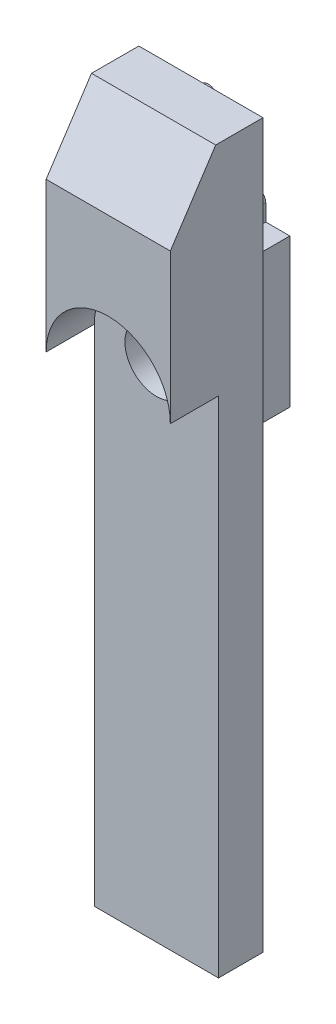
ISO-10303-21;
HEADER;
FILE_DESCRIPTION(('STEP AP214'),'2;1');
FILE_NAME('part.step','',(''),(''),'','','');
FILE_SCHEMA(('AUTOMOTIVE_DESIGN { 1 0 10303 214 1 1 1 1 }'));
ENDSEC;
DATA;
#1=APPLICATION_CONTEXT('core data for automotive mechanical design processes');
#2=APPLICATION_PROTOCOL_DEFINITION('international standard','automotive_design',2000,#1);
#3=PRODUCT_CONTEXT('',#1,'mechanical');
#4=PRODUCT('Part','Part','',(#3));
#5=PRODUCT_RELATED_PRODUCT_CATEGORY('part','',(#4));
#6=PRODUCT_DEFINITION_FORMATION('','',#4);
#7=PRODUCT_DEFINITION_CONTEXT('part definition',#1,'design');
#8=PRODUCT_DEFINITION('design','',#6,#7);
#9=PRODUCT_DEFINITION_SHAPE('','',#8);
#10=(LENGTH_UNIT() NAMED_UNIT(*) SI_UNIT(.MILLI.,.METRE.));
#11=(NAMED_UNIT(*) PLANE_ANGLE_UNIT() SI_UNIT($,.RADIAN.));
#12=(NAMED_UNIT(*) SI_UNIT($,.STERADIAN.) SOLID_ANGLE_UNIT());
#13=UNCERTAINTY_MEASURE_WITH_UNIT(LENGTH_MEASURE(1.E-05),#10,'distance_accuracy_value','');
#14=(GEOMETRIC_REPRESENTATION_CONTEXT(3) GLOBAL_UNCERTAINTY_ASSIGNED_CONTEXT((#13)) GLOBAL_UNIT_ASSIGNED_CONTEXT((#10,
#11,#12)) REPRESENTATION_CONTEXT('',''));
#15=CARTESIAN_POINT('',(0.,0.,0.));
#16=DIRECTION('',(0.,0.,1.));
#17=DIRECTION('',(1.,0.,0.));
#18=AXIS2_PLACEMENT_3D('',#15,#16,#17);
#19=CARTESIAN_POINT('',(16.75,97.5,0.));
#20=DIRECTION('',(0.,0.,-1.));
#21=DIRECTION('',(-1.,0.,0.));
#22=AXIS2_PLACEMENT_3D('',#19,#20,#21);
#23=PLANE('',#22);
#24=CARTESIAN_POINT('',(0.,93.5,0.));
#25=DIRECTION('',(0.,0.,-1.));
#26=DIRECTION('',(-1.,0.,0.));
#27=AXIS2_PLACEMENT_3D('',#24,#25,#26);
#28=CIRCLE('',#27,2.5);
#29=CARTESIAN_POINT('',(-2.5,93.5,0.));
#30=VERTEX_POINT('',#29);
#31=EDGE_CURVE('E518',#30,#30,#28,.T.);
#32=ORIENTED_EDGE('',*,*,#31,.F.);
#33=EDGE_LOOP('',(#32));
#34=FACE_BOUND('',#33,.T.);
#35=DIRECTION('',(0.,1.,0.));
#36=VECTOR('',#35,1.);
#37=CARTESIAN_POINT('',(16.75,-97.5,0.));
#38=LINE('',#37,#36);
#39=CARTESIAN_POINT('',(16.75,-97.5,0.));
#40=VERTEX_POINT('',#39);
#41=CARTESIAN_POINT('',(16.75,97.5,0.));
#42=VERTEX_POINT('',#41);
#43=EDGE_CURVE('E221',#40,#42,#38,.T.);
#44=ORIENTED_EDGE('',*,*,#43,.F.);
#45=DIRECTION('',(1.,0.,0.));
#46=VECTOR('',#45,1.);
#47=CARTESIAN_POINT('',(-16.75,-97.5,0.));
#48=LINE('',#47,#46);
#49=CARTESIAN_POINT('',(-16.75,-97.5,0.));
#50=VERTEX_POINT('',#49);
#51=EDGE_CURVE('E227',#50,#40,#48,.T.);
#52=ORIENTED_EDGE('',*,*,#51,.F.);
#53=DIRECTION('',(0.,-1.,0.));
#54=VECTOR('',#53,1.);
#55=CARTESIAN_POINT('',(-16.75,-97.5,0.));
#56=LINE('',#55,#54);
#57=CARTESIAN_POINT('',(-16.75,97.5,0.));
#58=VERTEX_POINT('',#57);
#59=EDGE_CURVE('E235',#58,#50,#56,.T.);
#60=ORIENTED_EDGE('',*,*,#59,.F.);
#61=DIRECTION('',(-1.,0.,0.));
#62=VECTOR('',#61,1.);
#63=CARTESIAN_POINT('',(-16.75,97.5,0.));
#64=LINE('',#63,#62);
#65=EDGE_CURVE('E232',#42,#58,#64,.T.);
#66=ORIENTED_EDGE('',*,*,#65,.F.);
#67=EDGE_LOOP('',(#44,#52,#60,#66));
#68=FACE_BOUND('',#67,.T.);
#69=DIRECTION('',(1.,0.,0.));
#70=VECTOR('',#69,1.);
#71=CARTESIAN_POINT('',(-2.5,58.5,0.));
#72=LINE('',#71,#70);
#73=CARTESIAN_POINT('',(-9.,58.5,0.));
#74=VERTEX_POINT('',#73);
#75=CARTESIAN_POINT('',(-2.5,58.5,0.));
#76=VERTEX_POINT('',#75);
#77=EDGE_CURVE('E552',#74,#76,#72,.T.);
#78=ORIENTED_EDGE('',*,*,#77,.F.);
#79=DIRECTION('',(0.,1.,0.));
#80=VECTOR('',#79,1.);
#81=CARTESIAN_POINT('',(-9.,18.5,0.));
#82=LINE('',#81,#80);
#83=CARTESIAN_POINT('',(-9.,18.5,0.));
#84=VERTEX_POINT('',#83);
#85=EDGE_CURVE('E188',#84,#74,#82,.T.);
#86=ORIENTED_EDGE('',*,*,#85,.F.);
#87=DIRECTION('',(-1.,0.,0.));
#88=VECTOR('',#87,1.);
#89=CARTESIAN_POINT('',(-2.5,18.5,0.));
#90=LINE('',#89,#88);
#91=CARTESIAN_POINT('',(-2.50000000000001,18.5,0.));
#92=VERTEX_POINT('',#91);
#93=EDGE_CURVE('E184',#92,#84,#90,.T.);
#94=ORIENTED_EDGE('',*,*,#93,.F.);
#95=DIRECTION('',(0.,1.,0.));
#96=VECTOR('',#95,1.);
#97=CARTESIAN_POINT('',(-2.5,18.5,0.));
#98=LINE('',#97,#96);
#99=CARTESIAN_POINT('',(-2.5,14.,0.));
#100=VERTEX_POINT('',#99);
#101=EDGE_CURVE('E570',#100,#92,#98,.T.);
#102=ORIENTED_EDGE('',*,*,#101,.F.);
#103=CARTESIAN_POINT('',(0.,14.,0.));
#104=DIRECTION('',(0.,0.,-1.));
#105=DIRECTION('',(1.,0.,0.));
#106=AXIS2_PLACEMENT_3D('',#103,#104,#105);
#107=CIRCLE('',#106,2.5);
#108=CARTESIAN_POINT('',(2.49999999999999,14.,0.));
#109=VERTEX_POINT('',#108);
#110=EDGE_CURVE('E568',#109,#100,#107,.T.);
#111=ORIENTED_EDGE('',*,*,#110,.F.);
#112=DIRECTION('',(0.,-1.,0.));
#113=VECTOR('',#112,1.);
#114=CARTESIAN_POINT('',(2.49999999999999,18.5,0.));
#115=LINE('',#114,#113);
#116=CARTESIAN_POINT('',(2.49999999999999,18.5,0.));
#117=VERTEX_POINT('',#116);
#118=EDGE_CURVE('E566',#117,#109,#115,.T.);
#119=ORIENTED_EDGE('',*,*,#118,.F.);
#120=DIRECTION('',(-1.,0.,0.));
#121=VECTOR('',#120,1.);
#122=CARTESIAN_POINT('',(9.,18.5,0.));
#123=LINE('',#122,#121);
#124=CARTESIAN_POINT('',(9.,18.5,0.));
#125=VERTEX_POINT('',#124);
#126=EDGE_CURVE('E564',#125,#117,#123,.T.);
#127=ORIENTED_EDGE('',*,*,#126,.F.);
#128=DIRECTION('',(0.,-1.,0.));
#129=VECTOR('',#128,1.);
#130=CARTESIAN_POINT('',(9.,18.5,0.));
#131=LINE('',#130,#129);
#132=CARTESIAN_POINT('',(9.,58.5,0.));
#133=VERTEX_POINT('',#132);
#134=EDGE_CURVE('E562',#133,#125,#131,.T.);
#135=ORIENTED_EDGE('',*,*,#134,.F.);
#136=DIRECTION('',(1.,0.,0.));
#137=VECTOR('',#136,1.);
#138=CARTESIAN_POINT('',(9.,58.5,0.));
#139=LINE('',#138,#137);
#140=CARTESIAN_POINT('',(2.49999999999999,58.5,0.));
#141=VERTEX_POINT('',#140);
#142=EDGE_CURVE('E560',#141,#133,#139,.T.);
#143=ORIENTED_EDGE('',*,*,#142,.F.);
#144=DIRECTION('',(0.,-1.,0.));
#145=VECTOR('',#144,1.);
#146=CARTESIAN_POINT('',(2.49999999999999,58.5,0.));
#147=LINE('',#146,#145);
#148=CARTESIAN_POINT('',(2.5,63.,0.));
#149=VERTEX_POINT('',#148);
#150=EDGE_CURVE('E558',#149,#141,#147,.T.);
#151=ORIENTED_EDGE('',*,*,#150,.F.);
#152=CARTESIAN_POINT('',(0.,63.,0.));
#153=DIRECTION('',(0.,0.,-1.));
#154=DIRECTION('',(-1.,0.,0.));
#155=AXIS2_PLACEMENT_3D('',#152,#153,#154);
#156=CIRCLE('',#155,2.5);
#157=CARTESIAN_POINT('',(-2.5,63.,0.));
#158=VERTEX_POINT('',#157);
#159=EDGE_CURVE('E556',#158,#149,#156,.T.);
#160=ORIENTED_EDGE('',*,*,#159,.F.);
#161=DIRECTION('',(0.,1.,0.));
#162=VECTOR('',#161,1.);
#163=CARTESIAN_POINT('',(-2.5,58.5,0.));
#164=LINE('',#163,#162);
#165=EDGE_CURVE('E554',#76,#158,#164,.T.);
#166=ORIENTED_EDGE('',*,*,#165,.F.);
#167=EDGE_LOOP('',(#78,#86,#94,#102,#111,#119,#127,#135,#143,#151,#160,#166));
#168=FACE_BOUND('',#167,.T.);
#169=CARTESIAN_POINT('',(0.,-71.5,0.));
#170=DIRECTION('',(0.,0.,-1.));
#171=DIRECTION('',(-1.,0.,0.));
#172=AXIS2_PLACEMENT_3D('',#169,#170,#171);
#173=CIRCLE('',#172,2.5);
#174=CARTESIAN_POINT('',(-2.5,-71.5,0.));
#175=VERTEX_POINT('',#174);
#176=EDGE_CURVE('E519',#175,#175,#173,.T.);
#177=ORIENTED_EDGE('',*,*,#176,.F.);
#178=EDGE_LOOP('',(#177));
#179=FACE_BOUND('',#178,.T.);
#180=ADVANCED_FACE('F32',(#34,#68,#168,#179),#23,.T.);
#181=CARTESIAN_POINT('',(16.75,-97.5,25.));
#182=DIRECTION('',(-1.,0.,0.));
#183=DIRECTION('',(0.,0.,1.));
#184=AXIS2_PLACEMENT_3D('',#181,#182,#183);
#185=PLANE('',#184);
#186=DIRECTION('',(0.,0.836047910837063,-0.548656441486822));
#187=VECTOR('',#186,1.);
#188=CARTESIAN_POINT('',(16.75,-44.4139980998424,105.892955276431));
#189=LINE('',#188,#187);
#190=CARTESIAN_POINT('',(16.75,78.8514575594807,25.));
#191=VERTEX_POINT('',#190);
#192=CARTESIAN_POINT('',(16.75,97.5,12.7618940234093));
#193=VERTEX_POINT('',#192);
#194=EDGE_CURVE('E202',#191,#193,#189,.T.);
#195=ORIENTED_EDGE('',*,*,#194,.F.);
#196=DIRECTION('',(0.,1.,0.));
#197=VECTOR('',#196,1.);
#198=CARTESIAN_POINT('',(16.75,-97.5,25.));
#199=LINE('',#198,#197);
#200=CARTESIAN_POINT('',(16.75,38.5,25.));
#201=VERTEX_POINT('',#200);
#202=EDGE_CURVE('E224',#201,#191,#199,.T.);
#203=ORIENTED_EDGE('',*,*,#202,.F.);
#204=DIRECTION('',(0.,0.,1.));
#205=VECTOR('',#204,1.);
#206=CARTESIAN_POINT('',(16.75,38.5,12.));
#207=LINE('',#206,#205);
#208=CARTESIAN_POINT('',(16.75,38.5,12.));
#209=VERTEX_POINT('',#208);
#210=EDGE_CURVE('E219',#209,#201,#207,.T.);
#211=ORIENTED_EDGE('',*,*,#210,.F.);
#212=DIRECTION('',(0.,1.,0.));
#213=VECTOR('',#212,1.);
#214=CARTESIAN_POINT('',(16.75,-97.5,12.));
#215=LINE('',#214,#213);
#216=CARTESIAN_POINT('',(16.75,-97.5,12.));
#217=VERTEX_POINT('',#216);
#218=EDGE_CURVE('E213',#217,#209,#215,.T.);
#219=ORIENTED_EDGE('',*,*,#218,.F.);
#220=DIRECTION('',(0.,0.,-1.));
#221=VECTOR('',#220,1.);
#222=CARTESIAN_POINT('',(16.75,-97.5,25.));
#223=LINE('',#222,#221);
#224=EDGE_CURVE('E229',#217,#40,#223,.T.);
#225=ORIENTED_EDGE('',*,*,#224,.T.);
#226=ORIENTED_EDGE('',*,*,#43,.T.);
#227=DIRECTION('',(0.,0.,-1.));
#228=VECTOR('',#227,1.);
#229=CARTESIAN_POINT('',(16.75,97.5,25.));
#230=LINE('',#229,#228);
#231=EDGE_CURVE('E40',#193,#42,#230,.T.);
#232=ORIENTED_EDGE('',*,*,#231,.F.);
#233=EDGE_LOOP('',(#195,#203,#211,#219,#225,#226,#232));
#234=FACE_BOUND('',#233,.T.);
#235=ADVANCED_FACE('F34',(#234),#185,.F.);
#236=CARTESIAN_POINT('',(-16.75,97.5,25.));
#237=DIRECTION('',(0.,-1.,0.));
#238=DIRECTION('',(0.,0.,-1.));
#239=AXIS2_PLACEMENT_3D('',#236,#237,#238);
#240=PLANE('',#239);
#241=DIRECTION('',(-1.,0.,0.));
#242=VECTOR('',#241,1.);
#243=CARTESIAN_POINT('',(-16.75,97.5,12.7618940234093));
#244=LINE('',#243,#242);
#245=CARTESIAN_POINT('',(-16.75,97.5,12.7618940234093));
#246=VERTEX_POINT('',#245);
#247=EDGE_CURVE('E55',#193,#246,#244,.T.);
#248=ORIENTED_EDGE('',*,*,#247,.F.);
#249=ORIENTED_EDGE('',*,*,#231,.T.);
#250=ORIENTED_EDGE('',*,*,#65,.T.);
#251=DIRECTION('',(0.,0.,-1.));
#252=VECTOR('',#251,1.);
#253=CARTESIAN_POINT('',(-16.75,97.5,25.));
#254=LINE('',#253,#252);
#255=EDGE_CURVE('E243',#246,#58,#254,.T.);
#256=ORIENTED_EDGE('',*,*,#255,.F.);
#257=EDGE_LOOP('',(#248,#249,#250,#256));
#258=FACE_BOUND('',#257,.T.);
#259=ADVANCED_FACE('F245',(#258),#240,.F.);
#260=CARTESIAN_POINT('',(-16.75,-97.5,25.));
#261=DIRECTION('',(1.,0.,0.));
#262=DIRECTION('',(0.,0.,-1.));
#263=AXIS2_PLACEMENT_3D('',#260,#261,#262);
#264=PLANE('',#263);
#265=DIRECTION('',(0.,-0.836047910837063,0.548656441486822));
#266=VECTOR('',#265,1.);
#267=CARTESIAN_POINT('',(-16.75,-44.4139980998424,105.892955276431));
#268=LINE('',#267,#266);
#269=CARTESIAN_POINT('',(-16.75,78.8514575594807,25.));
#270=VERTEX_POINT('',#269);
#271=EDGE_CURVE('E193',#246,#270,#268,.T.);
#272=ORIENTED_EDGE('',*,*,#271,.F.);
#273=ORIENTED_EDGE('',*,*,#255,.T.);
#274=ORIENTED_EDGE('',*,*,#59,.T.);
#275=DIRECTION('',(0.,0.,-1.));
#276=VECTOR('',#275,1.);
#277=CARTESIAN_POINT('',(-16.75,-97.5,25.));
#278=LINE('',#277,#276);
#279=CARTESIAN_POINT('',(-16.75,-97.5,12.));
#280=VERTEX_POINT('',#279);
#281=EDGE_CURVE('E241',#280,#50,#278,.T.);
#282=ORIENTED_EDGE('',*,*,#281,.F.);
#283=DIRECTION('',(0.,-1.,0.));
#284=VECTOR('',#283,1.);
#285=CARTESIAN_POINT('',(-16.75,38.5,12.));
#286=LINE('',#285,#284);
#287=CARTESIAN_POINT('',(-16.75,38.5,12.));
#288=VERTEX_POINT('',#287);
#289=EDGE_CURVE('E209',#288,#280,#286,.T.);
#290=ORIENTED_EDGE('',*,*,#289,.F.);
#291=DIRECTION('',(0.,0.,1.));
#292=VECTOR('',#291,1.);
#293=CARTESIAN_POINT('',(-16.75,38.5,12.));
#294=LINE('',#293,#292);
#295=CARTESIAN_POINT('',(-16.75,38.5,25.));
#296=VERTEX_POINT('',#295);
#297=EDGE_CURVE('E216',#288,#296,#294,.T.);
#298=ORIENTED_EDGE('',*,*,#297,.T.);
#299=DIRECTION('',(0.,-1.,0.));
#300=VECTOR('',#299,1.);
#301=CARTESIAN_POINT('',(-16.75,-97.5,25.));
#302=LINE('',#301,#300);
#303=EDGE_CURVE('E226',#270,#296,#302,.T.);
#304=ORIENTED_EDGE('',*,*,#303,.F.);
#305=EDGE_LOOP('',(#272,#273,#274,#282,#290,#298,#304));
#306=FACE_BOUND('',#305,.T.);
#307=ADVANCED_FACE('F262',(#306),#264,.F.);
#308=CARTESIAN_POINT('',(16.75,97.5,25.));
#309=DIRECTION('',(0.,0.,-1.));
#310=DIRECTION('',(-1.,0.,0.));
#311=AXIS2_PLACEMENT_3D('',#308,#309,#310);
#312=PLANE('',#311);
#313=DIRECTION('',(1.,0.,0.));
#314=VECTOR('',#313,1.);
#315=CARTESIAN_POINT('',(16.75,78.8514575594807,25.));
#316=LINE('',#315,#314);
#317=EDGE_CURVE('E11',#270,#191,#316,.T.);
#318=ORIENTED_EDGE('',*,*,#317,.F.);
#319=ORIENTED_EDGE('',*,*,#303,.T.);
#320=CARTESIAN_POINT('',(0.,38.5,25.));
#321=DIRECTION('',(0.,0.,1.));
#322=DIRECTION('',(1.,0.,0.));
#323=AXIS2_PLACEMENT_3D('',#320,#321,#322);
#324=CIRCLE('',#323,16.75);
#325=EDGE_CURVE('E205',#201,#296,#324,.T.);
#326=ORIENTED_EDGE('',*,*,#325,.F.);
#327=ORIENTED_EDGE('',*,*,#202,.T.);
#328=EDGE_LOOP('',(#318,#319,#326,#327));
#329=FACE_BOUND('',#328,.T.);
#330=ADVANCED_FACE('F269',(#329),#312,.F.);
#331=CARTESIAN_POINT('',(-16.75,-97.5,25.));
#332=DIRECTION('',(0.,1.,0.));
#333=DIRECTION('',(0.,0.,1.));
#334=AXIS2_PLACEMENT_3D('',#331,#332,#333);
#335=PLANE('',#334);
#336=DIRECTION('',(1.,0.,0.));
#337=VECTOR('',#336,1.);
#338=CARTESIAN_POINT('',(-16.75,-97.5,12.));
#339=LINE('',#338,#337);
#340=EDGE_CURVE('E211',#280,#217,#339,.T.);
#341=ORIENTED_EDGE('',*,*,#340,.F.);
#342=ORIENTED_EDGE('',*,*,#281,.T.);
#343=ORIENTED_EDGE('',*,*,#51,.T.);
#344=ORIENTED_EDGE('',*,*,#224,.F.);
#345=EDGE_LOOP('',(#341,#342,#343,#344));
#346=FACE_BOUND('',#345,.T.);
#347=ADVANCED_FACE('F258',(#346),#335,.F.);
#348=CARTESIAN_POINT('',(0.,38.5,12.));
#349=DIRECTION('',(0.,0.,1.));
#350=DIRECTION('',(1.,0.,0.));
#351=AXIS2_PLACEMENT_3D('',#348,#349,#350);
#352=CYLINDRICAL_SURFACE('',#351,16.75);
#353=ORIENTED_EDGE('',*,*,#325,.T.);
#354=ORIENTED_EDGE('',*,*,#297,.F.);
#355=CARTESIAN_POINT('',(0.,38.5,12.));
#356=DIRECTION('',(0.,0.,1.));
#357=DIRECTION('',(1.,0.,0.));
#358=AXIS2_PLACEMENT_3D('',#355,#356,#357);
#359=CIRCLE('',#358,16.75);
#360=EDGE_CURVE('E206',#209,#288,#359,.T.);
#361=ORIENTED_EDGE('',*,*,#360,.F.);
#362=ORIENTED_EDGE('',*,*,#210,.T.);
#363=EDGE_LOOP('',(#353,#354,#361,#362));
#364=FACE_BOUND('',#363,.T.);
#365=ADVANCED_FACE('F271',(#364),#352,.F.);
#366=CARTESIAN_POINT('',(0.,38.5,12.));
#367=DIRECTION('',(0.,0.,1.));
#368=DIRECTION('',(1.,0.,0.));
#369=AXIS2_PLACEMENT_3D('',#366,#367,#368);
#370=PLANE('',#369);
#371=CARTESIAN_POINT('',(0.,38.5,12.));
#372=DIRECTION('',(0.,0.,1.));
#373=DIRECTION('',(1.,0.,0.));
#374=AXIS2_PLACEMENT_3D('',#371,#372,#373);
#375=CIRCLE('',#374,8.5);
#376=CARTESIAN_POINT('',(8.50000000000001,38.5,12.));
#377=VERTEX_POINT('',#376);
#378=EDGE_CURVE('E190',#377,#377,#375,.T.);
#379=ORIENTED_EDGE('',*,*,#378,.F.);
#380=EDGE_LOOP('',(#379));
#381=FACE_BOUND('',#380,.T.);
#382=ORIENTED_EDGE('',*,*,#360,.T.);
#383=ORIENTED_EDGE('',*,*,#289,.T.);
#384=ORIENTED_EDGE('',*,*,#340,.T.);
#385=ORIENTED_EDGE('',*,*,#218,.T.);
#386=EDGE_LOOP('',(#382,#383,#384,#385));
#387=FACE_BOUND('',#386,.T.);
#388=ADVANCED_FACE('F273',(#381,#387),#370,.T.);
#389=CARTESIAN_POINT('',(-307.912265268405,108.506063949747,5.53916455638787));
#390=DIRECTION('',(0.,0.548656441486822,0.836047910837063));
#391=DIRECTION('',(0.,-0.836047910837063,0.548656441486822));
#392=AXIS2_PLACEMENT_3D('',#389,#390,#391);
#393=PLANE('',#392);
#394=ORIENTED_EDGE('',*,*,#317,.T.);
#395=ORIENTED_EDGE('',*,*,#194,.T.);
#396=ORIENTED_EDGE('',*,*,#247,.T.);
#397=ORIENTED_EDGE('',*,*,#271,.T.);
#398=EDGE_LOOP('',(#394,#395,#396,#397));
#399=FACE_BOUND('',#398,.T.);
#400=ADVANCED_FACE('F265',(#399),#393,.T.);
#401=CARTESIAN_POINT('',(0.,38.5,0.));
#402=DIRECTION('',(0.,0.,1.));
#403=DIRECTION('',(1.,0.,0.));
#404=AXIS2_PLACEMENT_3D('',#401,#402,#403);
#405=CYLINDRICAL_SURFACE('',#404,8.5);
#406=CARTESIAN_POINT('',(0.,38.5,-15.));
#407=DIRECTION('',(0.,0.,-1.));
#408=DIRECTION('',(-1.,0.,0.));
#409=AXIS2_PLACEMENT_3D('',#406,#407,#408);
#410=CIRCLE('',#409,8.5);
#411=CARTESIAN_POINT('',(8.50000000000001,38.5,-15.));
#412=VERTEX_POINT('',#411);
#413=EDGE_CURVE('E528',#412,#412,#410,.T.);
#414=CARTESIAN_POINT('',(8.50000000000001,38.5,12.));
#415=CARTESIAN_POINT('',(8.50000000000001,38.5,11.71875));
#416=CARTESIAN_POINT('',(8.50000000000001,38.5,11.4375));
#417=CARTESIAN_POINT('',(8.50000000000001,38.5,10.875));
#418=CARTESIAN_POINT('',(8.50000000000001,38.5,10.59375));
#419=CARTESIAN_POINT('',(8.50000000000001,38.5,10.03125));
#420=CARTESIAN_POINT('',(8.50000000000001,38.5,9.75));
#421=CARTESIAN_POINT('',(8.50000000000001,38.5,9.1875));
#422=CARTESIAN_POINT('',(8.50000000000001,38.5,8.90625));
#423=CARTESIAN_POINT('',(8.50000000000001,38.5,8.34375));
#424=CARTESIAN_POINT('',(8.50000000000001,38.5,8.0625));
#425=CARTESIAN_POINT('',(8.50000000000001,38.5,7.5));
#426=CARTESIAN_POINT('',(8.50000000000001,38.5,7.21875));
#427=CARTESIAN_POINT('',(8.50000000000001,38.5,6.65625));
#428=CARTESIAN_POINT('',(8.50000000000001,38.5,6.375));
#429=CARTESIAN_POINT('',(8.50000000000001,38.5,5.8125));
#430=CARTESIAN_POINT('',(8.50000000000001,38.5,5.53125));
#431=CARTESIAN_POINT('',(8.50000000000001,38.5,4.96875));
#432=CARTESIAN_POINT('',(8.50000000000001,38.5,4.6875));
#433=CARTESIAN_POINT('',(8.50000000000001,38.5,4.125));
#434=CARTESIAN_POINT('',(8.50000000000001,38.5,3.84375));
#435=CARTESIAN_POINT('',(8.50000000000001,38.5,3.28125));
#436=CARTESIAN_POINT('',(8.50000000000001,38.5,3.));
#437=CARTESIAN_POINT('',(8.50000000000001,38.5,2.4375));
#438=CARTESIAN_POINT('',(8.50000000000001,38.5,2.15625));
#439=CARTESIAN_POINT('',(8.50000000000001,38.5,1.59375));
#440=CARTESIAN_POINT('',(8.50000000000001,38.5,1.3125));
#441=CARTESIAN_POINT('',(8.50000000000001,38.5,0.750000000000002));
#442=CARTESIAN_POINT('',(8.50000000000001,38.5,0.468750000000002));
#443=CARTESIAN_POINT('',(8.50000000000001,38.5,-0.0937499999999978));
#444=CARTESIAN_POINT('',(8.50000000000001,38.5,-0.374999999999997));
#445=CARTESIAN_POINT('',(8.50000000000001,38.5,-0.937499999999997));
#446=CARTESIAN_POINT('',(8.50000000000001,38.5,-1.21875));
#447=CARTESIAN_POINT('',(8.50000000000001,38.5,-1.78125));
#448=CARTESIAN_POINT('',(8.50000000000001,38.5,-2.0625));
#449=CARTESIAN_POINT('',(8.50000000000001,38.5,-2.625));
#450=CARTESIAN_POINT('',(8.50000000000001,38.5,-2.90625));
#451=CARTESIAN_POINT('',(8.50000000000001,38.5,-3.46875));
#452=CARTESIAN_POINT('',(8.50000000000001,38.5,-3.75));
#453=CARTESIAN_POINT('',(8.50000000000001,38.5,-4.3125));
#454=CARTESIAN_POINT('',(8.50000000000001,38.5,-4.59375));
#455=CARTESIAN_POINT('',(8.50000000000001,38.5,-5.15625));
#456=CARTESIAN_POINT('',(8.50000000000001,38.5,-5.4375));
#457=CARTESIAN_POINT('',(8.50000000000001,38.5,-6.));
#458=CARTESIAN_POINT('',(8.50000000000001,38.5,-6.28125));
#459=CARTESIAN_POINT('',(8.50000000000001,38.5,-6.84375));
#460=CARTESIAN_POINT('',(8.50000000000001,38.5,-7.125));
#461=CARTESIAN_POINT('',(8.50000000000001,38.5,-7.6875));
#462=CARTESIAN_POINT('',(8.50000000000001,38.5,-7.96875));
#463=CARTESIAN_POINT('',(8.50000000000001,38.5,-8.53125));
#464=CARTESIAN_POINT('',(8.50000000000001,38.5,-8.8125));
#465=CARTESIAN_POINT('',(8.50000000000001,38.5,-9.375));
#466=CARTESIAN_POINT('',(8.50000000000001,38.5,-9.65625));
#467=CARTESIAN_POINT('',(8.50000000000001,38.5,-10.21875));
#468=CARTESIAN_POINT('',(8.50000000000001,38.5,-10.5));
#469=CARTESIAN_POINT('',(8.50000000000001,38.5,-11.0625));
#470=CARTESIAN_POINT('',(8.50000000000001,38.5,-11.34375));
#471=CARTESIAN_POINT('',(8.50000000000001,38.5,-11.90625));
#472=CARTESIAN_POINT('',(8.50000000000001,38.5,-12.1875));
#473=CARTESIAN_POINT('',(8.50000000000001,38.5,-12.75));
#474=CARTESIAN_POINT('',(8.50000000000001,38.5,-13.03125));
#475=CARTESIAN_POINT('',(8.50000000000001,38.5,-13.59375));
#476=CARTESIAN_POINT('',(8.50000000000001,38.5,-13.875));
#477=CARTESIAN_POINT('',(8.50000000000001,38.5,-14.4375));
#478=CARTESIAN_POINT('',(8.50000000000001,38.5,-14.71875));
#479=CARTESIAN_POINT('',(8.50000000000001,38.5,-15.));
#480=B_SPLINE_CURVE_WITH_KNOTS('',3,(#414,#415,#416,#417,#418,#419,#420,#421,#422,#423,#424,
#425,#426,#427,#428,#429,#430,#431,#432,#433,#434,#435,#436,#437,#438,#439,#440,#441,#442,#443,
#444,#445,#446,#447,#448,#449,#450,#451,#452,#453,#454,#455,#456,#457,#458,#459,#460,#461,#462,
#463,#464,#465,#466,#467,#468,#469,#470,#471,#472,#473,#474,#475,#476,#477,#478,#479),
.UNSPECIFIED.,.F.,.F.,(4,2,2,2,2,2,2,2,2,2,2,2,2,2,2,2,2,2,2,2,2,2,2,2,2,2,2,2,2,2,2,2,4),(0.,
0.843750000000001,1.6875,2.53125,3.375,4.21875,5.0625,5.90625,6.75,7.59375,8.4375,9.28125,
10.125,10.96875,11.8125,12.65625,13.5,14.34375,15.1875,16.03125,16.875,17.71875,18.5625,
19.40625,20.25,21.09375,21.9375,22.78125,23.625,24.46875,25.3125,26.15625,27.),.UNSPECIFIED.);
#481=EDGE_CURVE('BSEAM281',#377,#412,#480,.T.);
#482=ORIENTED_EDGE('',*,*,#378,.T.);
#483=ORIENTED_EDGE('',*,*,#413,.T.);
#484=ORIENTED_EDGE('',*,*,#481,.T.);
#485=ORIENTED_EDGE('',*,*,#481,.F.);
#486=EDGE_LOOP('',(#482,#484,#483,#485));
#487=FACE_BOUND('',#486,.T.);
#488=ADVANCED_FACE('F281',(#487),#405,.F.);
#489=CARTESIAN_POINT('',(0.,63.,-15.));
#490=DIRECTION('',(0.,0.,-1.));
#491=DIRECTION('',(-1.,0.,0.));
#492=AXIS2_PLACEMENT_3D('',#489,#490,#491);
#493=PLANE('',#492);
#494=DIRECTION('',(0.,1.,0.));
#495=VECTOR('',#494,1.);
#496=CARTESIAN_POINT('',(-9.,18.5,-15.));
#497=LINE('',#496,#495);
#498=CARTESIAN_POINT('',(-9.,18.5,-15.));
#499=VERTEX_POINT('',#498);
#500=CARTESIAN_POINT('',(-9.,58.5,-15.));
#501=VERTEX_POINT('',#500);
#502=EDGE_CURVE('E175',#499,#501,#497,.T.);
#503=ORIENTED_EDGE('',*,*,#502,.T.);
#504=DIRECTION('',(1.,0.,0.));
#505=VECTOR('',#504,1.);
#506=CARTESIAN_POINT('',(-2.5,58.5,-15.));
#507=LINE('',#506,#505);
#508=CARTESIAN_POINT('',(-2.5,58.5,-15.));
#509=VERTEX_POINT('',#508);
#510=EDGE_CURVE('E164',#501,#509,#507,.T.);
#511=ORIENTED_EDGE('',*,*,#510,.T.);
#512=DIRECTION('',(0.,1.,0.));
#513=VECTOR('',#512,1.);
#514=CARTESIAN_POINT('',(-2.5,58.5,-15.));
#515=LINE('',#514,#513);
#516=CARTESIAN_POINT('',(-2.5,63.,-15.));
#517=VERTEX_POINT('',#516);
#518=EDGE_CURVE('E174',#509,#517,#515,.T.);
#519=ORIENTED_EDGE('',*,*,#518,.T.);
#520=CARTESIAN_POINT('',(0.,63.,-15.));
#521=DIRECTION('',(0.,0.,-1.));
#522=DIRECTION('',(-1.,0.,0.));
#523=AXIS2_PLACEMENT_3D('',#520,#521,#522);
#524=CIRCLE('',#523,2.5);
#525=CARTESIAN_POINT('',(2.5,63.,-15.));
#526=VERTEX_POINT('',#525);
#527=EDGE_CURVE('E533',#517,#526,#524,.T.);
#528=ORIENTED_EDGE('',*,*,#527,.T.);
#529=DIRECTION('',(0.,-1.,0.));
#530=VECTOR('',#529,1.);
#531=CARTESIAN_POINT('',(2.49999999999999,58.5,-15.));
#532=LINE('',#531,#530);
#533=CARTESIAN_POINT('',(2.49999999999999,58.5,-15.));
#534=VERTEX_POINT('',#533);
#535=EDGE_CURVE('E535',#526,#534,#532,.T.);
#536=ORIENTED_EDGE('',*,*,#535,.T.);
#537=DIRECTION('',(1.,0.,0.));
#538=VECTOR('',#537,1.);
#539=CARTESIAN_POINT('',(9.,58.5,-15.));
#540=LINE('',#539,#538);
#541=CARTESIAN_POINT('',(9.,58.5,-15.));
#542=VERTEX_POINT('',#541);
#543=EDGE_CURVE('E537',#534,#542,#540,.T.);
#544=ORIENTED_EDGE('',*,*,#543,.T.);
#545=DIRECTION('',(0.,-1.,0.));
#546=VECTOR('',#545,1.);
#547=CARTESIAN_POINT('',(9.,18.5,-15.));
#548=LINE('',#547,#546);
#549=CARTESIAN_POINT('',(9.,18.5,-15.));
#550=VERTEX_POINT('',#549);
#551=EDGE_CURVE('E539',#542,#550,#548,.T.);
#552=ORIENTED_EDGE('',*,*,#551,.T.);
#553=DIRECTION('',(-1.,0.,0.));
#554=VECTOR('',#553,1.);
#555=CARTESIAN_POINT('',(9.,18.5,-15.));
#556=LINE('',#555,#554);
#557=CARTESIAN_POINT('',(2.49999999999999,18.5,-15.));
#558=VERTEX_POINT('',#557);
#559=EDGE_CURVE('E541',#550,#558,#556,.T.);
#560=ORIENTED_EDGE('',*,*,#559,.T.);
#561=DIRECTION('',(0.,-1.,0.));
#562=VECTOR('',#561,1.);
#563=CARTESIAN_POINT('',(2.49999999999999,18.5,-15.));
#564=LINE('',#563,#562);
#565=CARTESIAN_POINT('',(2.49999999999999,14.,-15.));
#566=VERTEX_POINT('',#565);
#567=EDGE_CURVE('E543',#558,#566,#564,.T.);
#568=ORIENTED_EDGE('',*,*,#567,.T.);
#569=CARTESIAN_POINT('',(0.,14.,-15.));
#570=DIRECTION('',(0.,0.,-1.));
#571=DIRECTION('',(1.,0.,0.));
#572=AXIS2_PLACEMENT_3D('',#569,#570,#571);
#573=CIRCLE('',#572,2.5);
#574=CARTESIAN_POINT('',(-2.5,14.,-15.));
#575=VERTEX_POINT('',#574);
#576=EDGE_CURVE('E545',#566,#575,#573,.T.);
#577=ORIENTED_EDGE('',*,*,#576,.T.);
#578=DIRECTION('',(0.,1.,0.));
#579=VECTOR('',#578,1.);
#580=CARTESIAN_POINT('',(-2.5,18.5,-15.));
#581=LINE('',#580,#579);
#582=CARTESIAN_POINT('',(-2.5,18.5,-15.));
#583=VERTEX_POINT('',#582);
#584=EDGE_CURVE('E547',#575,#583,#581,.T.);
#585=ORIENTED_EDGE('',*,*,#584,.T.);
#586=DIRECTION('',(-1.,0.,0.));
#587=VECTOR('',#586,1.);
#588=CARTESIAN_POINT('',(-2.5,18.5,-15.));
#589=LINE('',#588,#587);
#590=EDGE_CURVE('E180',#583,#499,#589,.T.);
#591=ORIENTED_EDGE('',*,*,#590,.T.);
#592=EDGE_LOOP('',(#503,#511,#519,#528,#536,#544,#552,#560,#568,#577,#585,#591));
#593=FACE_BOUND('',#592,.T.);
#594=ORIENTED_EDGE('',*,*,#413,.F.);
#595=EDGE_LOOP('',(#594));
#596=FACE_BOUND('',#595,.T.);
#597=ADVANCED_FACE('F178',(#593,#596),#493,.T.);
#598=CARTESIAN_POINT('',(-9.,18.5,-15.));
#599=DIRECTION('',(1.,0.,0.));
#600=DIRECTION('',(0.,0.,-1.));
#601=AXIS2_PLACEMENT_3D('',#598,#599,#600);
#602=PLANE('',#601);
#603=ORIENTED_EDGE('',*,*,#85,.T.);
#604=DIRECTION('',(0.,0.,1.));
#605=VECTOR('',#604,1.);
#606=CARTESIAN_POINT('',(-9.,58.5,-15.));
#607=LINE('',#606,#605);
#608=EDGE_CURVE('E168',#501,#74,#607,.T.);
#609=ORIENTED_EDGE('',*,*,#608,.F.);
#610=ORIENTED_EDGE('',*,*,#502,.F.);
#611=DIRECTION('',(0.,0.,1.));
#612=VECTOR('',#611,1.);
#613=CARTESIAN_POINT('',(-9.,18.5,-15.));
#614=LINE('',#613,#612);
#615=EDGE_CURVE('E550',#499,#84,#614,.T.);
#616=ORIENTED_EDGE('',*,*,#615,.T.);
#617=EDGE_LOOP('',(#603,#609,#610,#616));
#618=FACE_BOUND('',#617,.T.);
#619=ADVANCED_FACE('F186',(#618),#602,.F.);
#620=CARTESIAN_POINT('',(-2.5,58.5,-15.));
#621=DIRECTION('',(0.,-1.,0.));
#622=DIRECTION('',(0.,0.,-1.));
#623=AXIS2_PLACEMENT_3D('',#620,#621,#622);
#624=PLANE('',#623);
#625=ORIENTED_EDGE('',*,*,#77,.T.);
#626=DIRECTION('',(0.,0.,1.));
#627=VECTOR('',#626,1.);
#628=CARTESIAN_POINT('',(-2.5,58.5,-15.));
#629=LINE('',#628,#627);
#630=EDGE_CURVE('E171',#509,#76,#629,.T.);
#631=ORIENTED_EDGE('',*,*,#630,.F.);
#632=ORIENTED_EDGE('',*,*,#510,.F.);
#633=ORIENTED_EDGE('',*,*,#608,.T.);
#634=EDGE_LOOP('',(#625,#631,#632,#633));
#635=FACE_BOUND('',#634,.T.);
#636=ADVANCED_FACE('F166',(#635),#624,.F.);
#637=CARTESIAN_POINT('',(-2.5,58.5,-15.));
#638=DIRECTION('',(1.,0.,0.));
#639=DIRECTION('',(0.,0.,-1.));
#640=AXIS2_PLACEMENT_3D('',#637,#638,#639);
#641=PLANE('',#640);
#642=ORIENTED_EDGE('',*,*,#165,.T.);
#643=DIRECTION('',(0.,0.,1.));
#644=VECTOR('',#643,1.);
#645=CARTESIAN_POINT('',(-2.5,63.,-15.));
#646=LINE('',#645,#644);
#647=EDGE_CURVE('E195',#517,#158,#646,.T.);
#648=ORIENTED_EDGE('',*,*,#647,.F.);
#649=ORIENTED_EDGE('',*,*,#518,.F.);
#650=ORIENTED_EDGE('',*,*,#630,.T.);
#651=EDGE_LOOP('',(#642,#648,#649,#650));
#652=FACE_BOUND('',#651,.T.);
#653=ADVANCED_FACE('F366',(#652),#641,.F.);
#654=CARTESIAN_POINT('',(0.,63.,-15.));
#655=DIRECTION('',(0.,0.,1.));
#656=DIRECTION('',(1.,0.,0.));
#657=AXIS2_PLACEMENT_3D('',#654,#655,#656);
#658=CYLINDRICAL_SURFACE('',#657,2.5);
#659=ORIENTED_EDGE('',*,*,#159,.T.);
#660=DIRECTION('',(0.,0.,1.));
#661=VECTOR('',#660,1.);
#662=CARTESIAN_POINT('',(2.5,63.,-15.));
#663=LINE('',#662,#661);
#664=EDGE_CURVE('E593',#526,#149,#663,.T.);
#665=ORIENTED_EDGE('',*,*,#664,.F.);
#666=ORIENTED_EDGE('',*,*,#527,.F.);
#667=ORIENTED_EDGE('',*,*,#647,.T.);
#668=EDGE_LOOP('',(#659,#665,#666,#667));
#669=FACE_BOUND('',#668,.T.);
#670=ADVANCED_FACE('F374',(#669),#658,.T.);
#671=CARTESIAN_POINT('',(2.49999999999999,58.5,-15.));
#672=DIRECTION('',(-1.,0.,0.));
#673=DIRECTION('',(0.,0.,1.));
#674=AXIS2_PLACEMENT_3D('',#671,#672,#673);
#675=PLANE('',#674);
#676=ORIENTED_EDGE('',*,*,#150,.T.);
#677=DIRECTION('',(0.,0.,1.));
#678=VECTOR('',#677,1.);
#679=CARTESIAN_POINT('',(2.49999999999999,58.5,-15.));
#680=LINE('',#679,#678);
#681=EDGE_CURVE('E590',#534,#141,#680,.T.);
#682=ORIENTED_EDGE('',*,*,#681,.F.);
#683=ORIENTED_EDGE('',*,*,#535,.F.);
#684=ORIENTED_EDGE('',*,*,#664,.T.);
#685=EDGE_LOOP('',(#676,#682,#683,#684));
#686=FACE_BOUND('',#685,.T.);
#687=ADVANCED_FACE('F383',(#686),#675,.F.);
#688=CARTESIAN_POINT('',(9.,58.5,-15.));
#689=DIRECTION('',(0.,-1.,0.));
#690=DIRECTION('',(0.,0.,-1.));
#691=AXIS2_PLACEMENT_3D('',#688,#689,#690);
#692=PLANE('',#691);
#693=ORIENTED_EDGE('',*,*,#142,.T.);
#694=DIRECTION('',(0.,0.,1.));
#695=VECTOR('',#694,1.);
#696=CARTESIAN_POINT('',(9.,58.5,-15.));
#697=LINE('',#696,#695);
#698=EDGE_CURVE('E587',#542,#133,#697,.T.);
#699=ORIENTED_EDGE('',*,*,#698,.F.);
#700=ORIENTED_EDGE('',*,*,#543,.F.);
#701=ORIENTED_EDGE('',*,*,#681,.T.);
#702=EDGE_LOOP('',(#693,#699,#700,#701));
#703=FACE_BOUND('',#702,.T.);
#704=ADVANCED_FACE('F392',(#703),#692,.F.);
#705=CARTESIAN_POINT('',(9.,18.5,-15.));
#706=DIRECTION('',(-1.,0.,0.));
#707=DIRECTION('',(0.,0.,1.));
#708=AXIS2_PLACEMENT_3D('',#705,#706,#707);
#709=PLANE('',#708);
#710=ORIENTED_EDGE('',*,*,#134,.T.);
#711=DIRECTION('',(0.,0.,1.));
#712=VECTOR('',#711,1.);
#713=CARTESIAN_POINT('',(9.,18.5,-15.));
#714=LINE('',#713,#712);
#715=EDGE_CURVE('E584',#550,#125,#714,.T.);
#716=ORIENTED_EDGE('',*,*,#715,.F.);
#717=ORIENTED_EDGE('',*,*,#551,.F.);
#718=ORIENTED_EDGE('',*,*,#698,.T.);
#719=EDGE_LOOP('',(#710,#716,#717,#718));
#720=FACE_BOUND('',#719,.T.);
#721=ADVANCED_FACE('F401',(#720),#709,.F.);
#722=CARTESIAN_POINT('',(9.,18.5,-15.));
#723=DIRECTION('',(0.,1.,0.));
#724=DIRECTION('',(-1.,0.,0.));
#725=AXIS2_PLACEMENT_3D('',#722,#723,#724);
#726=PLANE('',#725);
#727=ORIENTED_EDGE('',*,*,#126,.T.);
#728=DIRECTION('',(0.,0.,1.));
#729=VECTOR('',#728,1.);
#730=CARTESIAN_POINT('',(2.49999999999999,18.5,-15.));
#731=LINE('',#730,#729);
#732=EDGE_CURVE('E581',#558,#117,#731,.T.);
#733=ORIENTED_EDGE('',*,*,#732,.F.);
#734=ORIENTED_EDGE('',*,*,#559,.F.);
#735=ORIENTED_EDGE('',*,*,#715,.T.);
#736=EDGE_LOOP('',(#727,#733,#734,#735));
#737=FACE_BOUND('',#736,.T.);
#738=ADVANCED_FACE('F410',(#737),#726,.F.);
#739=CARTESIAN_POINT('',(2.49999999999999,18.5,-15.));
#740=DIRECTION('',(-1.,0.,0.));
#741=DIRECTION('',(0.,-1.,0.));
#742=AXIS2_PLACEMENT_3D('',#739,#740,#741);
#743=PLANE('',#742);
#744=ORIENTED_EDGE('',*,*,#118,.T.);
#745=DIRECTION('',(0.,0.,1.));
#746=VECTOR('',#745,1.);
#747=CARTESIAN_POINT('',(2.49999999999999,14.,-15.));
#748=LINE('',#747,#746);
#749=EDGE_CURVE('E578',#566,#109,#748,.T.);
#750=ORIENTED_EDGE('',*,*,#749,.F.);
#751=ORIENTED_EDGE('',*,*,#567,.F.);
#752=ORIENTED_EDGE('',*,*,#732,.T.);
#753=EDGE_LOOP('',(#744,#750,#751,#752));
#754=FACE_BOUND('',#753,.T.);
#755=ADVANCED_FACE('F419',(#754),#743,.F.);
#756=CARTESIAN_POINT('',(0.,14.,-15.));
#757=DIRECTION('',(0.,0.,1.));
#758=DIRECTION('',(1.,0.,0.));
#759=AXIS2_PLACEMENT_3D('',#756,#757,#758);
#760=CYLINDRICAL_SURFACE('',#759,2.5);
#761=ORIENTED_EDGE('',*,*,#110,.T.);
#762=DIRECTION('',(0.,0.,1.));
#763=VECTOR('',#762,1.);
#764=CARTESIAN_POINT('',(-2.5,14.,-15.));
#765=LINE('',#764,#763);
#766=EDGE_CURVE('E575',#575,#100,#765,.T.);
#767=ORIENTED_EDGE('',*,*,#766,.F.);
#768=ORIENTED_EDGE('',*,*,#576,.F.);
#769=ORIENTED_EDGE('',*,*,#749,.T.);
#770=EDGE_LOOP('',(#761,#767,#768,#769));
#771=FACE_BOUND('',#770,.T.);
#772=ADVANCED_FACE('F428',(#771),#760,.T.);
#773=CARTESIAN_POINT('',(-2.5,18.5,-15.));
#774=DIRECTION('',(1.,0.,0.));
#775=DIRECTION('',(0.,1.,0.));
#776=AXIS2_PLACEMENT_3D('',#773,#774,#775);
#777=PLANE('',#776);
#778=ORIENTED_EDGE('',*,*,#101,.T.);
#779=DIRECTION('',(0.,0.,1.));
#780=VECTOR('',#779,1.);
#781=CARTESIAN_POINT('',(-2.5,18.5,-15.));
#782=LINE('',#781,#780);
#783=EDGE_CURVE('E47',#583,#92,#782,.T.);
#784=ORIENTED_EDGE('',*,*,#783,.F.);
#785=ORIENTED_EDGE('',*,*,#584,.F.);
#786=ORIENTED_EDGE('',*,*,#766,.T.);
#787=EDGE_LOOP('',(#778,#784,#785,#786));
#788=FACE_BOUND('',#787,.T.);
#789=ADVANCED_FACE('F437',(#788),#777,.F.);
#790=CARTESIAN_POINT('',(-2.5,18.5,-15.));
#791=DIRECTION('',(0.,1.,0.));
#792=DIRECTION('',(-1.,0.,0.));
#793=AXIS2_PLACEMENT_3D('',#790,#791,#792);
#794=PLANE('',#793);
#795=ORIENTED_EDGE('',*,*,#93,.T.);
#796=ORIENTED_EDGE('',*,*,#615,.F.);
#797=ORIENTED_EDGE('',*,*,#590,.F.);
#798=ORIENTED_EDGE('',*,*,#783,.T.);
#799=EDGE_LOOP('',(#795,#796,#797,#798));
#800=FACE_BOUND('',#799,.T.);
#801=ADVANCED_FACE('F446',(#800),#794,.F.);
#802=CARTESIAN_POINT('',(0.,93.5,-2.));
#803=DIRECTION('',(0.,0.,1.));
#804=DIRECTION('',(1.,0.,0.));
#805=AXIS2_PLACEMENT_3D('',#802,#803,#804);
#806=CYLINDRICAL_SURFACE('',#805,2.5);
#807=CARTESIAN_POINT('',(0.,93.5,-2.));
#808=DIRECTION('',(0.,0.,-1.));
#809=DIRECTION('',(-1.,0.,0.));
#810=AXIS2_PLACEMENT_3D('',#807,#808,#809);
#811=CIRCLE('',#810,2.5);
#812=CARTESIAN_POINT('',(-2.5,93.5,-2.));
#813=VERTEX_POINT('',#812);
#814=EDGE_CURVE('E522',#813,#813,#811,.T.);
#815=ORIENTED_EDGE('',*,*,#814,.F.);
#816=EDGE_LOOP('',(#815));
#817=FACE_BOUND('',#816,.T.);
#818=ORIENTED_EDGE('',*,*,#31,.T.);
#819=EDGE_LOOP('',(#818));
#820=FACE_BOUND('',#819,.T.);
#821=ADVANCED_FACE('F455',(#817,#820),#806,.T.);
#822=CARTESIAN_POINT('',(0.,93.5,-2.));
#823=DIRECTION('',(0.,0.,-1.));
#824=DIRECTION('',(-1.,0.,0.));
#825=AXIS2_PLACEMENT_3D('',#822,#823,#824);
#826=PLANE('',#825);
#827=ORIENTED_EDGE('',*,*,#814,.T.);
#828=EDGE_LOOP('',(#827));
#829=FACE_BOUND('',#828,.T.);
#830=ADVANCED_FACE('F467',(#829),#826,.T.);
#831=CARTESIAN_POINT('',(0.,-71.5,-2.));
#832=DIRECTION('',(0.,0.,1.));
#833=DIRECTION('',(1.,0.,0.));
#834=AXIS2_PLACEMENT_3D('',#831,#832,#833);
#835=CYLINDRICAL_SURFACE('',#834,2.5);
#836=CARTESIAN_POINT('',(0.,-71.5,-2.));
#837=DIRECTION('',(0.,0.,-1.));
#838=DIRECTION('',(-1.,0.,0.));
#839=AXIS2_PLACEMENT_3D('',#836,#837,#838);
#840=CIRCLE('',#839,2.5);
#841=CARTESIAN_POINT('',(-2.5,-71.5,-2.));
#842=VERTEX_POINT('',#841);
#843=EDGE_CURVE('E517',#842,#842,#840,.T.);
#844=ORIENTED_EDGE('',*,*,#843,.F.);
#845=EDGE_LOOP('',(#844));
#846=FACE_BOUND('',#845,.T.);
#847=ORIENTED_EDGE('',*,*,#176,.T.);
#848=EDGE_LOOP('',(#847));
#849=FACE_BOUND('',#848,.T.);
#850=ADVANCED_FACE('F476',(#846,#849),#835,.T.);
#851=CARTESIAN_POINT('',(0.,-71.5,-2.));
#852=DIRECTION('',(0.,0.,-1.));
#853=DIRECTION('',(-1.,0.,0.));
#854=AXIS2_PLACEMENT_3D('',#851,#852,#853);
#855=PLANE('',#854);
#856=ORIENTED_EDGE('',*,*,#843,.T.);
#857=EDGE_LOOP('',(#856));
#858=FACE_BOUND('',#857,.T.);
#859=ADVANCED_FACE('F485',(#858),#855,.T.);
#860=CLOSED_SHELL('',(#180,#235,#259,#307,#330,#347,#365,#388,#400,#488,#597,#619,#636,#653,
#670,#687,#704,#721,#738,#755,#772,#789,#801,#821,#830,#850,#859));
#861=MANIFOLD_SOLID_BREP('B2',#860);
#862=ADVANCED_BREP_SHAPE_REPRESENTATION('',(#18,#861),#14);
#863=SHAPE_DEFINITION_REPRESENTATION(#9,#862);
ENDSEC;
END-ISO-10303-21;
